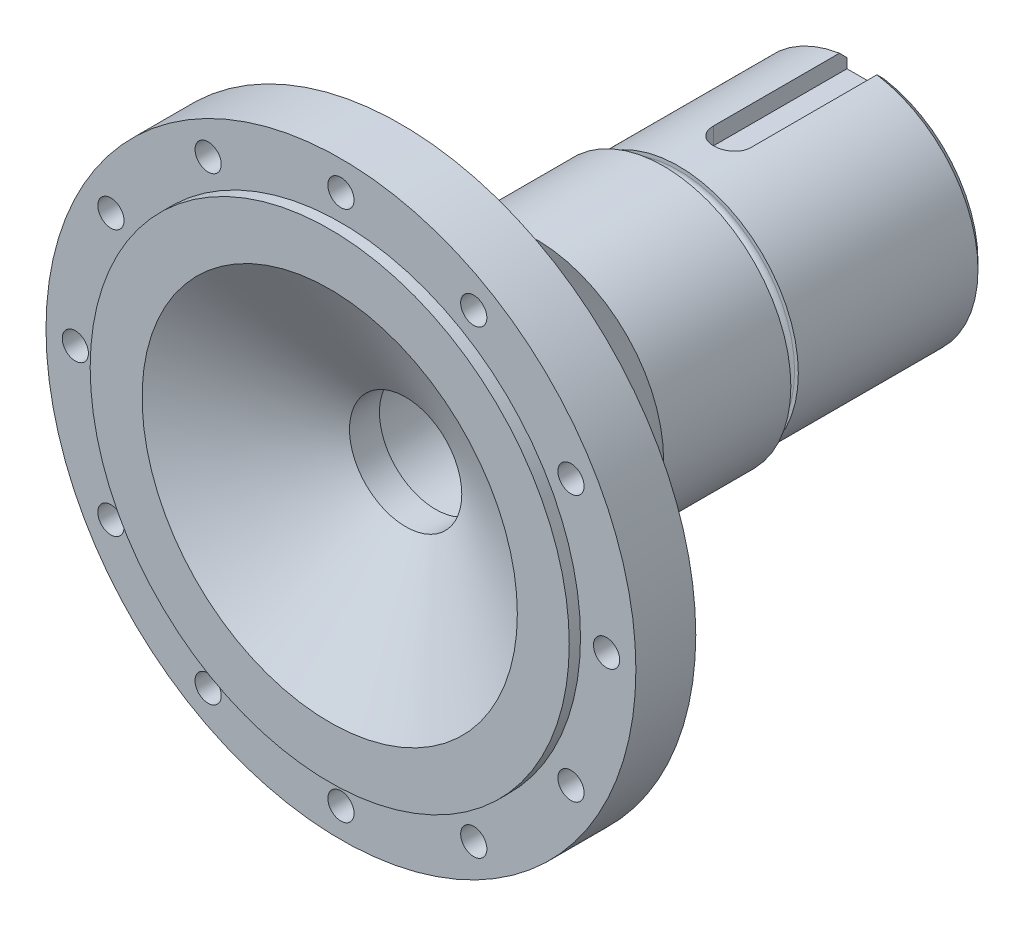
from build123d import *

# Parameters (mm, degrees)
ESQUISSE2_R                  = 1.75
ENL_V_MAT_EXTRU_1_DEPTH      = 92.316070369
R_P_TITION_CIRCULAIRE1_COUNT = 12
ENL_V_MAT_EXTRU_3_DEPTH      = 10
CHANFREIN2_SIZE              = 1


with BuildPart() as part:
    # Esquisse1 → R_volution1 (revolve)
    with BuildSketch(Plane(origin=(0, 0, 0), x_dir=(0, 0, -1), z_dir=(1, 0, 0)), mode=Mode.PRIVATE) as r_volution1_sk:
        with BuildLine():
            Line((28.345730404, 17), (16.745730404, 26.733555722))
            Line((16.745730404, 26.733555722), (16.745730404, 28))
            Line((16.745730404, 28), (10.245730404, 28))
            Line((10.245730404, 28), (10.245730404, 39.4))
            Line((10.245730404, 39.4), (2.245730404, 39.4))
            Line((2.245730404, 39.4), (2.245730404, 32))
            Line((2.245730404, 32), (0.745730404, 32))
            Line((0.745730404, 32), (0.745730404, 25.065249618))
            Line((0.745730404, 25.065249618), (10.887031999, 7.5))
            Line((10.887031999, 7.5), (14.887031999, 7.5))
            Line((14.887031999, 7.5), (14.887031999, 8.5))
            Line((14.887031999, 8.5), (62.345730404, 8.5))
            Line((62.345730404, 8.5), (62.345730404, 10.75))
            Line((62.345730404, 10.75), (64.112627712, 10.75))
            Line((64.112627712, 10.75), (72.345730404, 12.5))
            Line((72.345730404, 12.5), (72.345730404, 16))
            Line((72.345730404, 16), (47.345730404, 16))
            Line((47.345730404, 16), (47.345730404, 15.5))
            ThreePointArc((47.345730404, 15.5), (46.345730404, 14.5), (45.345730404, 15.5))
            Line((45.345730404, 15.5), (45.345730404, 17))
            Line((45.345730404, 17), (28.345730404, 17))
        make_face()
    revolve(r_volution1_sk.sketch.rotate(Axis((0, 0, 61.81759686), (0, 0, -1)), 90), axis=Axis((0, 0, 61.81759686), (0, 0, -1)))

    # Esquisse2 → Enl_v. mat.-Extru.1 (cut, through all)
    with BuildSketch(Plane.XY):
        with Locations((0, 35.482539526)):
            Circle(ESQUISSE2_R)
    enl_v_mat_extru_1 = extrude(amount=-ENL_V_MAT_EXTRU_1_DEPTH, mode=Mode.SUBTRACT)

    # R_p_tition circulaire1: Enl_v. mat.-Extru.1 ×12 about axis
    r_p_tition_circulaire1_axis = Axis((0, 0, 0), (0, 0, 1))
    for i in range(1, R_P_TITION_CIRCULAIRE1_COUNT):
        add(enl_v_mat_extru_1.rotate(r_p_tition_circulaire1_axis, i * 360 / R_P_TITION_CIRCULAIRE1_COUNT), mode=Mode.SUBTRACT)

    # Esquisse4 → Enl_v. mat.-Extru.3 (cut)
    with BuildSketch(Plane(origin=(0, 13.5, 0), x_dir=(-1, 0, 0), z_dir=(0, 1, 0))):
        with BuildLine():
            Line((-2.5, -72.479705), (-2.5, -54.510874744))
            ThreePointArc((-2.5, -54.510874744), (0, -52.010874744), (2.5, -54.510874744))
            Line((2.5, -54.510874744), (2.5, -72.479705))
            Line((2.5, -72.479705), (-2.5, -72.479705))
        make_face()
    extrude(amount=ENL_V_MAT_EXTRU_3_DEPTH, mode=Mode.SUBTRACT)

    # Chanfrein2
    chanfrein2_edges = [part.edges().sort_by_distance(p)[0] for p in [
        (-10.392304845, -12.165525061, -72.345730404),
    ]]
    chamfer(chanfrein2_edges, length=CHANFREIN2_SIZE)


solid = part.part
